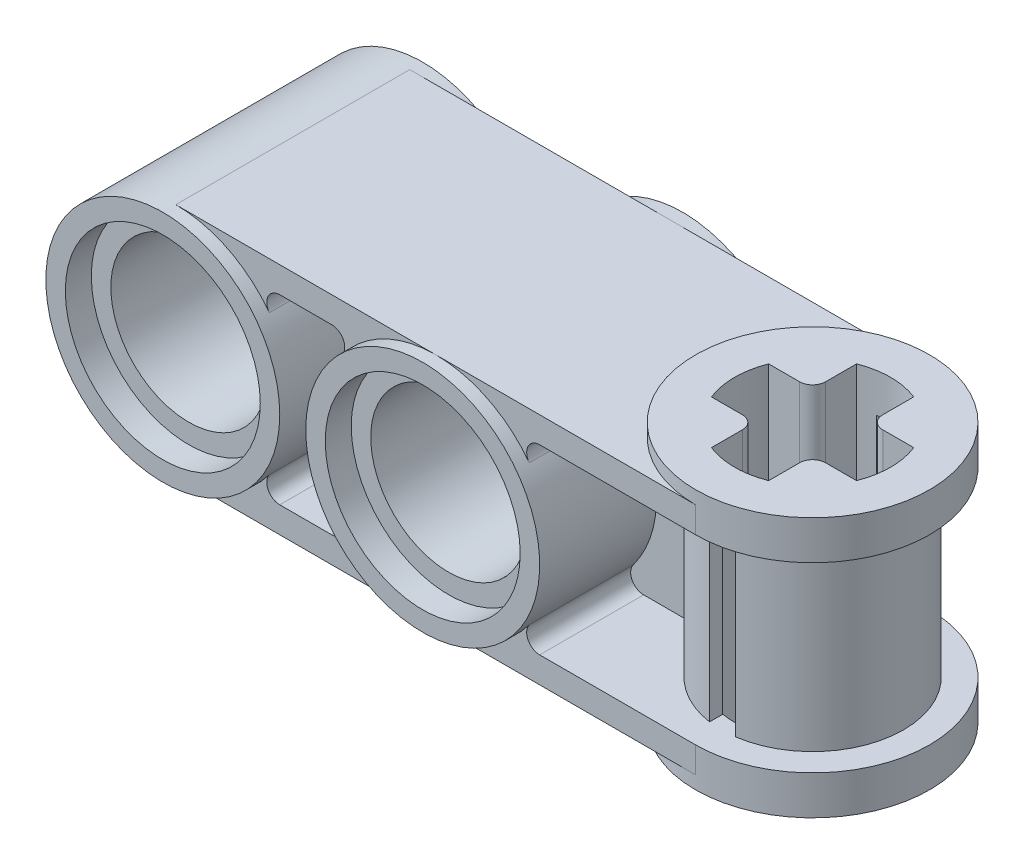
from build123d import *

# Parameters (mm, degrees)
BOSS_EXTRUDE1_DEPTH      = 3.6
BOSS_EXTRUDE1_DEPTH_BACK = 3.6
BOSS_EXTRUDE2_DEPTH      = 0.4
BOSS_EXTRUDE2_DEPTH_BACK = 7.6
CUT_EXTRUDE1_DEPTH       = 15.327595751
CUT_EXTRUDE1_DEPTH_BACK  = 15.327595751
SKETCH3_R                = 2.4
SKETCH4_R                = 3
CUT_EXTRUDE2_DEPTH       = 0.4
SKETCH5_R                = 3.6
BOSS_EXTRUDE3_DEPTH      = 0.4
CUT_EXTRUDE3_DEPTH       = 15.647866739
CUT_EXTRUDE4_DEPTH       = 3.2
CUT_EXTRUDE6_DEPTH       = 2.8
CUT_EXTRUDE6_DEPTH_BACK  = 2.8
SKETCH9_W                = 0.8
SKETCH9_H                = 5.6
CUT_EXTRUDE7_DEPTH       = 15.433294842
BOSS_EXTRUDE4_DEPTH      = 4
BOSS_EXTRUDE4_DEPTH_BACK = 4
SKETCH10_R               = 2.4
SKETCH11_R               = 3
CUT_EXTRUDE8_DEPTH       = 0.8
CUT_EXTRUDE9_START       = -3.2
CUT_EXTRUDE9_DEPTH       = 3.2
CUT_EXTRUDE10_START      = -0.4
CUT_EXTRUDE10_DEPTH      = 0.4


with BuildPart() as part:
    # Sketch1 → Boss-Extrude1 (new, two sides: drawn at the far end of the back side and taken through both)
    with BuildSketch(Plane(origin=(0, 0, 0), x_dir=(1, 0, 0), z_dir=(0, 1, 0)).offset(-BOSS_EXTRUDE1_DEPTH_BACK)):
        with BuildLine():
            Line((0, 3.6), (-8, 3.6))
            Line((-8, 3.6), (-8, -3.6))
            Line((-8, -3.6), (0, -3.6))
            ThreePointArc((0, -3.6), (3.6, 0), (0, 3.6))
        make_face()
    extrude(amount=BOSS_EXTRUDE1_DEPTH + BOSS_EXTRUDE1_DEPTH_BACK)

    # Sketch2 → Boss-Extrude2 (add, two sides: drawn at the far end of the back side and taken through both)
    with BuildSketch(Plane.XY.offset(3.6).offset(-BOSS_EXTRUDE2_DEPTH_BACK)):
        with BuildLine():
            ThreePointArc((-8, 3.6), (-11.6, 0), (-8, -3.6))
            ThreePointArc((-8, -3.6), (-4.4, 0), (-8, 3.6))
        make_face()
    extrude(amount=BOSS_EXTRUDE2_DEPTH + BOSS_EXTRUDE2_DEPTH_BACK)

    # Sketch3 → Cut-Extrude1 (cut, two sides: drawn at the far end of the back side and taken through both)
    with BuildSketch(Plane.XY.offset(3.6).offset(-CUT_EXTRUDE1_DEPTH_BACK)):
        with Locations((-8, 0)):
            Circle(SKETCH3_R)
    extrude(amount=CUT_EXTRUDE1_DEPTH + CUT_EXTRUDE1_DEPTH_BACK, mode=Mode.SUBTRACT)

    # Sketch4 → Cut-Extrude2 (cut, symmetric)
    with BuildSketch(Plane.XY.offset(3.6)):
        with Locations((-8, 0)):
            Circle(SKETCH4_R)
    cut_extrude2 = extrude(amount=CUT_EXTRUDE2_DEPTH, both=True, mode=Mode.SUBTRACT)

    # Mirror1: Cut-Extrude2 across plane
    add(cut_extrude2.mirror(Plane.XY), mode=Mode.SUBTRACT)

    # Sketch5 → Boss-Extrude3 (add)
    with BuildSketch(Plane(origin=(0, 3.6, 0), x_dir=(1, 0, 0), z_dir=(0, 1, 0))):
        with Locations(Location((0, 0, 0), (0, 0, 270))):
            Circle(SKETCH5_R)
    boss_extrude3 = extrude(amount=BOSS_EXTRUDE3_DEPTH)

    # Mirror2: Boss-Extrude3 across plane
    add(boss_extrude3.mirror(Plane.ZX))

    # Sketch6 → Cut-Extrude3 (cut, through all)
    with BuildSketch(Plane(origin=(0, 4, 0), x_dir=(1, 0, 0), z_dir=(0, 1, 0))):
        with BuildLine():
            Line((-0.88, 2.232845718), (-0.88, 1.28))
            ThreePointArc((-0.88, 1.28), (-0.997157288, 0.997157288), (-1.28, 0.88))
            Line((-1.28, 0.88), (-2.232845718, 0.88))
            ThreePointArc((-2.232845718, 0.88), (-2.4, 0), (-2.232845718, -0.88))
            Line((-2.232845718, -0.88), (-1.28, -0.88))
            ThreePointArc((-1.28, -0.88), (-0.997157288, -0.997157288), (-0.88, -1.28))
            Line((-0.88, -1.28), (-0.88, -2.232845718))
            ThreePointArc((-0.88, -2.232845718), (0, -2.4), (0.88, -2.232845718))
            Line((0.88, -2.232845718), (0.88, -1.28))
            ThreePointArc((0.88, -1.28), (0.997157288, -0.997157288), (1.28, -0.88))
            Line((1.28, -0.88), (2.232845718, -0.88))
            ThreePointArc((2.232845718, -0.88), (2.4, 0), (2.232845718, 0.88))
            Line((2.232845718, 0.88), (1.28, 0.88))
            ThreePointArc((1.28, 0.88), (0.997157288, 0.997157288), (0.88, 1.28))
            Line((0.88, 1.28), (0.88, 2.232845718))
            ThreePointArc((0.88, 2.232845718), (0, 2.4), (-0.88, 2.232845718))
        make_face()
    extrude(amount=-CUT_EXTRUDE3_DEPTH, mode=Mode.SUBTRACT)

    # Sketch7 → Cut-Extrude4 (cut)
    with BuildSketch(Plane.XY.offset(3.6)):
        with BuildLine():
            Line((-4, 2.8), (-4, -2.8))
            Line((-4, -2.8), (-4.8, -2.8))
            ThreePointArc((-4.8, -2.8), (-5.157770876, -2.578885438), (-5.12, -2.16))
            ThreePointArc((-5.12, -2.16), (-4.4, 0), (-5.12, 2.16))
            ThreePointArc((-5.12, 2.16), (-5.157770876, 2.578885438), (-4.8, 2.8))
            Line((-4.8, 2.8), (-4, 2.8))
        make_face()
    cut_extrude4 = extrude(amount=-CUT_EXTRUDE4_DEPTH, mode=Mode.SUBTRACT)

    # Mirror3: Cut-Extrude4 across plane
    add(cut_extrude4.mirror(Plane.XY), mode=Mode.SUBTRACT)

    # Sketch8 → Cut-Extrude6 (cut, two sides: drawn at the far end of the back side and taken through both)
    with BuildSketch(Plane(origin=(0, 0, 0), x_dir=(1, 0, 0), z_dir=(0, 1, 0)).offset(-CUT_EXTRUDE6_DEPTH_BACK)):
        with BuildLine():
            Line((-2.771281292, 0.4), (-4.117178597, 0.4))
            Line((-4.117178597, 0.4), (-4.117178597, 5.37406554))
            Line((-4.117178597, 5.37406554), (4.164604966, 5.37406554))
            Line((4.164604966, 5.37406554), (4.164604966, -5.523115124))
            Line((4.164604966, -5.523115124), (-4.117178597, -5.523115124))
            Line((-4.117178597, -5.523115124), (-4.117178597, -0.4))
            Line((-4.117178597, -0.4), (-2.771281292, -0.4))
            ThreePointArc((-2.771281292, -0.4), (2.8, 0), (-2.771281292, 0.4))
        make_face()
    extrude(amount=CUT_EXTRUDE6_DEPTH + CUT_EXTRUDE6_DEPTH_BACK, mode=Mode.SUBTRACT)

    # Sketch9 → Cut-Extrude7 (cut, through all)
    with BuildSketch(Plane.XY.offset(3.6)):
        Rectangle(SKETCH9_W, SKETCH9_H)
    extrude(amount=-CUT_EXTRUDE7_DEPTH, mode=Mode.SUBTRACT)

    # Sketch10 → Boss-Extrude4 (add, two sides: drawn at the far end of the back side and taken through both)
    with BuildSketch(Plane.XY.offset(-BOSS_EXTRUDE4_DEPTH_BACK)):
        with BuildLine():
            Line((-16, 3.6), (-8, 3.6))
            ThreePointArc((-8, 3.6), (-11.6, 0), (-8, -3.6))
            Line((-8, -3.6), (-16, -3.6))
            ThreePointArc((-16, -3.6), (-19.6, 0), (-16, 3.6))
        make_face()
        with Locations((-16, 0)):
            Circle(SKETCH10_R, mode=Mode.SUBTRACT)
    extrude(amount=BOSS_EXTRUDE4_DEPTH + BOSS_EXTRUDE4_DEPTH_BACK)

    # Sketch11 → Cut-Extrude8 (cut)
    with BuildSketch(Plane.XY.offset(4)):
        with Locations((-16, 0)):
            Circle(SKETCH11_R)
    cut_extrude8 = extrude(amount=-CUT_EXTRUDE8_DEPTH, mode=Mode.SUBTRACT)

    # Sketch12 → Cut-Extrude9 (cut)
    with BuildSketch(Plane.XY.offset(4).offset(CUT_EXTRUDE9_START)):
        with BuildLine():
            Line((-12.8, 2.8), (-11.2, 2.8))
            ThreePointArc((-11.2, 2.8), (-10.842229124, 2.578885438), (-10.88, 2.16))
            ThreePointArc((-10.88, 2.16), (-11.6, 0), (-10.88, -2.16))
            ThreePointArc((-10.88, -2.16), (-10.842229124, -2.578885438), (-11.2, -2.8))
            Line((-11.2, -2.8), (-12.8, -2.8))
            ThreePointArc((-12.8, -2.8), (-13.157770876, -2.578885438), (-13.12, -2.16))
            ThreePointArc((-13.12, -2.16), (-12.4, 0), (-13.12, 2.16))
            ThreePointArc((-13.12, 2.16), (-13.157770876, 2.578885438), (-12.8, 2.8))
        make_face()
    cut_extrude9 = extrude(amount=CUT_EXTRUDE9_DEPTH, mode=Mode.SUBTRACT)

    # Sketch13 → Cut-Extrude10 (cut)
    with BuildSketch(Plane.XY.offset(4).offset(CUT_EXTRUDE10_START)):
        with BuildLine():
            Line((-16, 3.6), (-11.904745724, 5.793729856))
            Line((-11.904745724, 5.793729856), (-8, 3.6))
            ThreePointArc((-8, 3.6), (-11.6, 0), (-8, -3.6))
            Line((-8, -3.6), (-11.904745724, -5.743018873))
            Line((-11.904745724, -5.743018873), (-16, -3.6))
            ThreePointArc((-16, -3.6), (-12.4, 0), (-16, 3.6))
        make_face()
    cut_extrude10 = extrude(amount=CUT_EXTRUDE10_DEPTH, mode=Mode.SUBTRACT)

    # Mirror4: Cut-Extrude8, Cut-Extrude9, Cut-Extrude10 across plane
    add(cut_extrude8.mirror(Plane.XY), mode=Mode.SUBTRACT)
    add(cut_extrude9.mirror(Plane.XY), mode=Mode.SUBTRACT)
    add(cut_extrude10.mirror(Plane.XY), mode=Mode.SUBTRACT)


solid = part.part
